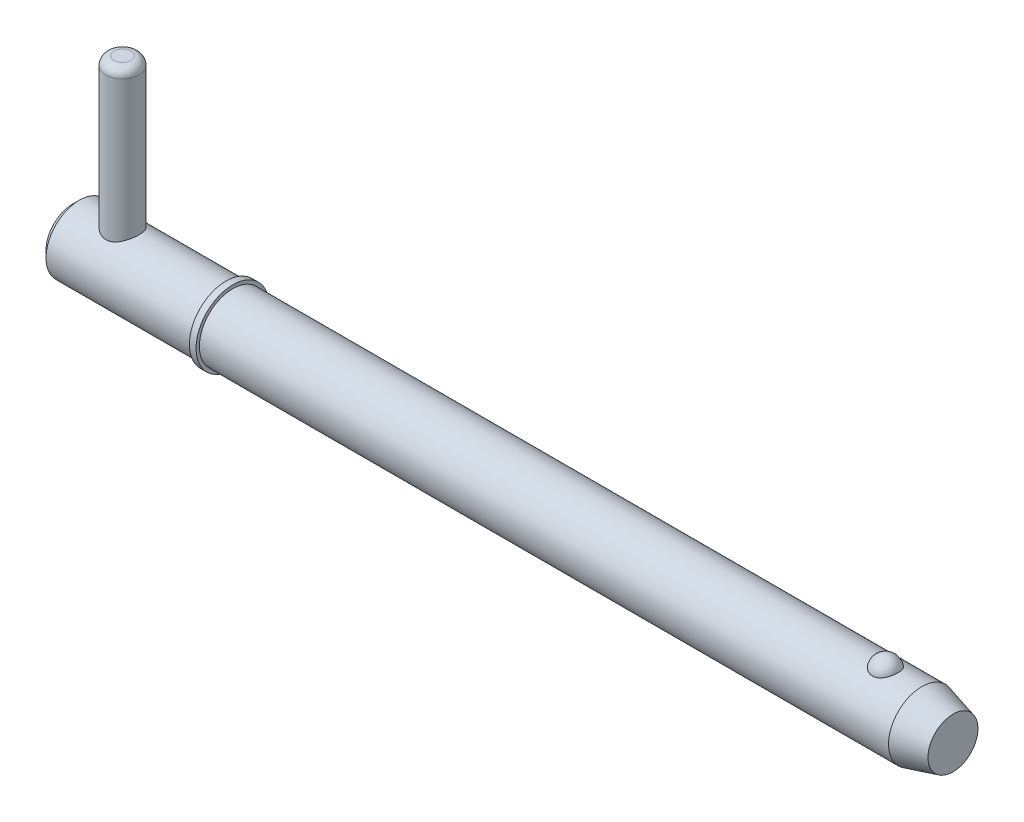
ISO-10303-21;
HEADER;
FILE_DESCRIPTION(('STEP AP214'),'2;1');
FILE_NAME('part.step','',(''),(''),'','','');
FILE_SCHEMA(('AUTOMOTIVE_DESIGN { 1 0 10303 214 1 1 1 1 }'));
ENDSEC;
DATA;
#1=APPLICATION_CONTEXT('core data for automotive mechanical design processes');
#2=APPLICATION_PROTOCOL_DEFINITION('international standard','automotive_design',2000,#1);
#3=PRODUCT_CONTEXT('',#1,'mechanical');
#4=PRODUCT('Part','Part','',(#3));
#5=PRODUCT_RELATED_PRODUCT_CATEGORY('part','',(#4));
#6=PRODUCT_DEFINITION_FORMATION('','',#4);
#7=PRODUCT_DEFINITION_CONTEXT('part definition',#1,'design');
#8=PRODUCT_DEFINITION('design','',#6,#7);
#9=PRODUCT_DEFINITION_SHAPE('','',#8);
#10=(LENGTH_UNIT() NAMED_UNIT(*) SI_UNIT(.MILLI.,.METRE.));
#11=(NAMED_UNIT(*) PLANE_ANGLE_UNIT() SI_UNIT($,.RADIAN.));
#12=(NAMED_UNIT(*) SI_UNIT($,.STERADIAN.) SOLID_ANGLE_UNIT());
#13=UNCERTAINTY_MEASURE_WITH_UNIT(LENGTH_MEASURE(1.E-05),#10,'distance_accuracy_value','');
#14=(GEOMETRIC_REPRESENTATION_CONTEXT(3) GLOBAL_UNCERTAINTY_ASSIGNED_CONTEXT((#13)) GLOBAL_UNIT_ASSIGNED_CONTEXT((#10,
#11,#12)) REPRESENTATION_CONTEXT('',''));
#15=CARTESIAN_POINT('',(0.,0.,0.));
#16=DIRECTION('',(0.,0.,1.));
#17=DIRECTION('',(1.,0.,0.));
#18=AXIS2_PLACEMENT_3D('',#15,#16,#17);
#19=CARTESIAN_POINT('',(5.94,21.43,0.));
#20=DIRECTION('',(0.,-1.,0.));
#21=DIRECTION('',(0.,0.,-1.));
#22=AXIS2_PLACEMENT_3D('',#19,#20,#21);
#23=CYLINDRICAL_SURFACE('',#22,1.98);
#24=CARTESIAN_POINT('',(5.94,-2.98,0.));
#25=DIRECTION('',(0.,1.,0.));
#26=DIRECTION('',(0.,0.,1.));
#27=AXIS2_PLACEMENT_3D('',#24,#25,#26);
#28=CIRCLE('',#27,1.98);
#29=CARTESIAN_POINT('',(5.94,-2.98,1.98));
#30=VERTEX_POINT('',#29);
#31=EDGE_CURVE('P0_E25',#30,#30,#28,.T.);
#32=ORIENTED_EDGE('',*,*,#31,.T.);
#33=EDGE_LOOP('',(#32));
#34=FACE_BOUND('',#33,.T.);
#35=CARTESIAN_POINT('',(5.94,20.44,0.));
#36=DIRECTION('',(0.,1.,0.));
#37=DIRECTION('',(0.,0.,1.));
#38=AXIS2_PLACEMENT_3D('',#35,#36,#37);
#39=CIRCLE('',#38,1.98);
#40=CARTESIAN_POINT('',(5.94,20.44,1.98));
#41=VERTEX_POINT('',#40);
#42=EDGE_CURVE('P0_E29',#41,#41,#39,.F.);
#43=ORIENTED_EDGE('',*,*,#42,.T.);
#44=EDGE_LOOP('',(#43));
#45=FACE_BOUND('',#44,.T.);
#46=ADVANCED_FACE('P0_F14',(#34,#45),#23,.T.);
#47=CARTESIAN_POINT('',(5.94,21.43,0.));
#48=DIRECTION('',(0.,1.,0.));
#49=DIRECTION('',(0.,0.,1.));
#50=AXIS2_PLACEMENT_3D('',#47,#48,#49);
#51=PLANE('',#50);
#52=CARTESIAN_POINT('',(5.94,21.43,0.));
#53=DIRECTION('',(0.,1.,0.));
#54=DIRECTION('',(0.,0.,1.));
#55=AXIS2_PLACEMENT_3D('',#52,#53,#54);
#56=CIRCLE('',#55,0.99);
#57=CARTESIAN_POINT('',(5.94,21.43,0.99));
#58=VERTEX_POINT('',#57);
#59=EDGE_CURVE('P0_E10',#58,#58,#56,.T.);
#60=ORIENTED_EDGE('',*,*,#59,.T.);
#61=EDGE_LOOP('',(#60));
#62=FACE_BOUND('',#61,.T.);
#63=ADVANCED_FACE('P0_F46',(#62),#51,.T.);
#64=CARTESIAN_POINT('',(5.94,-3.97,0.));
#65=DIRECTION('',(0.,1.,0.));
#66=DIRECTION('',(0.,0.,1.));
#67=AXIS2_PLACEMENT_3D('',#64,#65,#66);
#68=PLANE('',#67);
#69=CARTESIAN_POINT('',(5.94,-3.97,0.));
#70=DIRECTION('',(0.,1.,0.));
#71=DIRECTION('',(0.,0.,1.));
#72=AXIS2_PLACEMENT_3D('',#69,#70,#71);
#73=CIRCLE('',#72,0.99);
#74=CARTESIAN_POINT('',(5.94,-3.97,0.99));
#75=VERTEX_POINT('',#74);
#76=EDGE_CURVE('P0_E21',#75,#75,#73,.F.);
#77=ORIENTED_EDGE('',*,*,#76,.T.);
#78=EDGE_LOOP('',(#77));
#79=FACE_BOUND('',#78,.T.);
#80=ADVANCED_FACE('P0_F43',(#79),#68,.F.);
#81=CARTESIAN_POINT('',(5.94,-2.98,0.));
#82=DIRECTION('',(0.,1.,0.));
#83=DIRECTION('',(0.,0.,1.));
#84=AXIS2_PLACEMENT_3D('',#81,#82,#83);
#85=DEGENERATE_TOROIDAL_SURFACE('',#84,0.99,0.99,.T.);
#86=ORIENTED_EDGE('',*,*,#76,.F.);
#87=EDGE_LOOP('',(#86));
#88=FACE_BOUND('',#87,.T.);
#89=ORIENTED_EDGE('',*,*,#31,.F.);
#90=EDGE_LOOP('',(#89));
#91=FACE_BOUND('',#90,.T.);
#92=ADVANCED_FACE('P0_F38',(#88,#91),#85,.T.);
#93=CARTESIAN_POINT('',(5.94,20.44,0.));
#94=DIRECTION('',(0.,1.,0.));
#95=DIRECTION('',(0.,0.,1.));
#96=AXIS2_PLACEMENT_3D('',#93,#94,#95);
#97=DEGENERATE_TOROIDAL_SURFACE('',#96,0.99,0.99,.T.);
#98=ORIENTED_EDGE('',*,*,#42,.F.);
#99=EDGE_LOOP('',(#98));
#100=FACE_BOUND('',#99,.T.);
#101=ORIENTED_EDGE('',*,*,#59,.F.);
#102=EDGE_LOOP('',(#101));
#103=FACE_BOUND('',#102,.T.);
#104=ADVANCED_FACE('P0_F16',(#100,#103),#97,.T.);
#105=CLOSED_SHELL('',(#46,#63,#80,#92,#104));
#106=MANIFOLD_SOLID_BREP('P0_B1',#105);
#107=CARTESIAN_POINT('',(0.,0.,0.));
#108=DIRECTION('',(1.,0.,0.));
#109=DIRECTION('',(0.,0.,-1.));
#110=AXIS2_PLACEMENT_3D('',#107,#108,#109);
#111=CYLINDRICAL_SURFACE('',#110,3.97);
#112=CARTESIAN_POINT('',(101.075939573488,0.,0.));
#113=DIRECTION('',(1.,0.,0.));
#114=DIRECTION('',(0.,0.,-1.));
#115=AXIS2_PLACEMENT_3D('',#112,#113,#114);
#116=CIRCLE('',#115,3.97);
#117=CARTESIAN_POINT('',(101.075939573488,0.,-3.97));
#118=VERTEX_POINT('',#117);
#119=EDGE_CURVE('P1_E81',#118,#118,#116,.T.);
#120=ORIENTED_EDGE('',*,*,#119,.F.);
#121=EDGE_LOOP('',(#120));
#122=FACE_BOUND('',#121,.T.);
#123=CARTESIAN_POINT('',(19.05,0.,0.));
#124=DIRECTION('',(1.,0.,0.));
#125=DIRECTION('',(0.,0.,-1.));
#126=AXIS2_PLACEMENT_3D('',#123,#124,#125);
#127=CIRCLE('',#126,3.97);
#128=CARTESIAN_POINT('',(19.05,0.,-3.97));
#129=VERTEX_POINT('',#128);
#130=EDGE_CURVE('P1_E85',#129,#129,#127,.T.);
#131=ORIENTED_EDGE('',*,*,#130,.T.);
#132=EDGE_LOOP('',(#131));
#133=FACE_BOUND('',#132,.T.);
#134=CARTESIAN_POINT('',(96.7451922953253,3.65715365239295,1.5447094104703));
#135=CARTESIAN_POINT('',(96.6652448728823,3.65716001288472,1.54470290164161));
#136=CARTESIAN_POINT('',(96.5851650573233,3.65987074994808,1.53832549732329));
#137=CARTESIAN_POINT('',(96.4272374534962,3.6704221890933,1.51297018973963));
#138=CARTESIAN_POINT('',(96.3493961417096,3.67827646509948,1.49395894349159));
#139=CARTESIAN_POINT('',(96.1984614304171,3.69818848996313,1.44395950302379));
#140=CARTESIAN_POINT('',(96.1253560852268,3.71023513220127,1.41300293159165));
#141=CARTESIAN_POINT('',(95.9855630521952,3.7372183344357,1.34000212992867));
#142=CARTESIAN_POINT('',(95.9188725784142,3.75215363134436,1.29796274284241));
#143=CARTESIAN_POINT('',(95.7914886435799,3.78384968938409,1.20248834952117));
#144=CARTESIAN_POINT('',(95.7310299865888,3.80065129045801,1.14875388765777));
#145=CARTESIAN_POINT('',(95.6196942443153,3.83398532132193,1.03205417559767));
#146=CARTESIAN_POINT('',(95.5688200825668,3.85051766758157,0.969086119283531));
#147=CARTESIAN_POINT('',(95.4756321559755,3.88238608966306,0.832526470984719));
#148=CARTESIAN_POINT('',(95.4337961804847,3.89763698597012,0.75858832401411));
#149=CARTESIAN_POINT('',(95.3625108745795,3.92451063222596,0.604352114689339));
#150=CARTESIAN_POINT('',(95.3330623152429,3.93613315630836,0.524053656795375));
#151=CARTESIAN_POINT('',(95.2868927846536,3.95467606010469,0.35840348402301));
#152=CARTESIAN_POINT('',(95.2703127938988,3.96154426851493,0.273006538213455));
#153=CARTESIAN_POINT('',(95.250756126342,3.96967008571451,0.100408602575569));
#154=CARTESIAN_POINT('',(95.2477789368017,3.97092790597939,0.0132076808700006));
#155=CARTESIAN_POINT('',(95.2554587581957,3.96771794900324,-0.159844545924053));
#156=CARTESIAN_POINT('',(95.2660164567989,3.96329187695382,-0.245701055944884));
#157=CARTESIAN_POINT('',(95.3003800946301,3.94923163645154,-0.414277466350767));
#158=CARTESIAN_POINT('',(95.3241862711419,3.93959737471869,-0.49699731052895));
#159=CARTESIAN_POINT('',(95.3846114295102,3.91607752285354,-0.657113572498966));
#160=CARTESIAN_POINT('',(95.4212495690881,3.90218558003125,-0.734501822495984));
#161=CARTESIAN_POINT('',(95.5065935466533,3.87158287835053,-0.881704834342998));
#162=CARTESIAN_POINT('',(95.5553004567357,3.85487186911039,-0.951518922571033));
#163=CARTESIAN_POINT('',(95.6641161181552,3.82028735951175,-1.08208159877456));
#164=CARTESIAN_POINT('',(95.7242955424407,3.80240713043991,-1.14276958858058));
#165=CARTESIAN_POINT('',(95.854493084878,3.76758161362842,-1.25282437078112));
#166=CARTESIAN_POINT('',(95.9245105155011,3.75063626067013,-1.30219195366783));
#167=CARTESIAN_POINT('',(96.07118160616,3.71998948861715,-1.38729709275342));
#168=CARTESIAN_POINT('',(96.1476813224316,3.70623183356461,-1.42327904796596));
#169=CARTESIAN_POINT('',(96.3062981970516,3.68323188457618,-1.48178996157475));
#170=CARTESIAN_POINT('',(96.3884132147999,3.67398788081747,-1.50432401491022));
#171=CARTESIAN_POINT('',(96.5514810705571,3.66152163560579,-1.53440939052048));
#172=CARTESIAN_POINT('',(96.6322840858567,3.65801951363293,-1.54265826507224));
#173=CARTESIAN_POINT('',(96.7942085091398,3.65657341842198,-1.54608423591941));
#174=CARTESIAN_POINT('',(96.8753298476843,3.65862829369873,-1.5412640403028));
#175=CARTESIAN_POINT('',(97.0328122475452,3.66788969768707,-1.51908474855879));
#176=CARTESIAN_POINT('',(97.1092422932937,3.67492621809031,-1.50213925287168));
#177=CARTESIAN_POINT('',(97.2580412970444,3.69318404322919,-1.45666982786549));
#178=CARTESIAN_POINT('',(97.3304099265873,3.7044056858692,-1.42814496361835));
#179=CARTESIAN_POINT('',(97.4708029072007,3.73012749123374,-1.35956319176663));
#180=CARTESIAN_POINT('',(97.5387000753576,3.74469307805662,-1.31927107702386));
#181=CARTESIAN_POINT('',(97.6668649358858,3.77545272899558,-1.22847440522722));
#182=CARTESIAN_POINT('',(97.7271308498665,3.79164717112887,-1.17796747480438));
#183=CARTESIAN_POINT('',(97.8416346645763,3.82490325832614,-1.06519260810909));
#184=CARTESIAN_POINT('',(97.8954137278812,3.84196735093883,-1.00245914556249));
#185=CARTESIAN_POINT('',(97.9920988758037,3.87439863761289,-0.868715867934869));
#186=CARTESIAN_POINT('',(98.0350030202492,3.88976552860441,-0.797704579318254));
#187=CARTESIAN_POINT('',(98.110266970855,3.91771381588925,-0.64689620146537));
#188=CARTESIAN_POINT('',(98.1422532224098,3.93019255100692,-0.566893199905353));
#189=CARTESIAN_POINT('',(98.1931101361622,3.95043886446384,-0.402255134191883));
#190=CARTESIAN_POINT('',(98.2119807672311,3.95820643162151,-0.317620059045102));
#191=CARTESIAN_POINT('',(98.2362162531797,3.96823733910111,-0.146156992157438));
#192=CARTESIAN_POINT('',(98.2415874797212,3.970503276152,-0.0593300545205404));
#193=CARTESIAN_POINT('',(98.2387309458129,3.96930811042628,0.114057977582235));
#194=CARTESIAN_POINT('',(98.2305035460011,3.9658471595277,0.20061907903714));
#195=CARTESIAN_POINT('',(98.2007063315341,3.95358562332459,0.37050665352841));
#196=CARTESIAN_POINT('',(98.1792129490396,3.94481563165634,0.453848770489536));
#197=CARTESIAN_POINT('',(98.1233839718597,3.92284586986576,0.615497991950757));
#198=CARTESIAN_POINT('',(98.0890474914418,3.90964579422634,0.693804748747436));
#199=CARTESIAN_POINT('',(98.0079702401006,3.88006987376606,0.8437030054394));
#200=CARTESIAN_POINT('',(97.9611536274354,3.86367478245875,0.915249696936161));
#201=CARTESIAN_POINT('',(97.8561897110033,3.82949741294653,1.04910810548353));
#202=CARTESIAN_POINT('',(97.7980428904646,3.81171519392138,1.11142021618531));
#203=CARTESIAN_POINT('',(97.6717433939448,3.7767336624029,1.22503948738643));
#204=CARTESIAN_POINT('',(97.6035970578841,3.75953398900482,1.27635357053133));
#205=CARTESIAN_POINT('',(97.4589009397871,3.72770506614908,1.36653336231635));
#206=CARTESIAN_POINT('',(97.382348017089,3.7130767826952,1.4053943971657));
#207=CARTESIAN_POINT('',(97.2257594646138,3.68864287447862,1.46830480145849));
#208=CARTESIAN_POINT('',(97.1459307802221,3.67869017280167,1.49281289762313));
#209=CARTESIAN_POINT('',(96.9829877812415,3.66414535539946,1.52817474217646));
#210=CARTESIAN_POINT('',(96.8998840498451,3.65953723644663,1.53906926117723));
#211=CARTESIAN_POINT('',(96.7927760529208,3.6573894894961,1.54414878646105));
#212=CARTESIAN_POINT('',(96.7689900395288,3.65715175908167,1.54471134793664));
#213=CARTESIAN_POINT('',(96.7451922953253,3.65715365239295,1.5447094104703));
#214=B_SPLINE_CURVE_WITH_KNOTS('',3,(#134,#135,#136,#137,#138,#139,#140,#141,#142,#143,#144,
#145,#146,#147,#148,#149,#150,#151,#152,#153,#154,#155,#156,#157,#158,#159,#160,#161,#162,#163,
#164,#165,#166,#167,#168,#169,#170,#171,#172,#173,#174,#175,#176,#177,#178,#179,#180,#181,#182,
#183,#184,#185,#186,#187,#188,#189,#190,#191,#192,#193,#194,#195,#196,#197,#198,#199,#200,#201,
#202,#203,#204,#205,#206,#207,#208,#209,#210,#211,#212,#213),.UNSPECIFIED.,.T.,.F.,(4,2,2,2,2,2,
2,2,2,2,2,2,2,2,2,2,2,2,2,2,2,2,2,2,2,2,2,2,2,2,2,2,2,2,2,2,2,2,2,4),(0.,0.239777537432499,
0.48019041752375,0.719971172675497,0.959647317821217,1.20639040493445,1.45320863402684,
1.71093679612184,1.96868099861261,2.22921052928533,2.48973023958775,2.74834928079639,
3.00697295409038,3.26598440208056,3.52501886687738,3.78570385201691,4.04637062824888,
4.30201257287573,4.55755760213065,4.80022994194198,5.04285200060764,5.2775700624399,
5.51230707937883,5.75210128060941,5.99195126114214,6.24392810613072,6.49594987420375,
6.75588818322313,7.01582710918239,7.27564332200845,7.53545264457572,7.79377886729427,
8.05212290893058,8.31207418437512,8.57201437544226,8.83179046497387,9.09166393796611,
9.34270057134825,9.59298357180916,9.66435753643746),.UNSPECIFIED.);
#215=CARTESIAN_POINT('',(96.7451922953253,3.65715365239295,1.5447094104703));
#216=VERTEX_POINT('',#215);
#217=EDGE_CURVE('P1_E35',#216,#216,#214,.T.);
#218=ORIENTED_EDGE('',*,*,#217,.T.);
#219=EDGE_LOOP('',(#218));
#220=FACE_BOUND('',#219,.T.);
#221=ADVANCED_FACE('P1_F13',(#122,#133,#220),#111,.T.);
#222=CARTESIAN_POINT('',(0.,0.,0.));
#223=DIRECTION('',(-1.,0.,0.));
#224=DIRECTION('',(0.,0.,1.));
#225=AXIS2_PLACEMENT_3D('',#222,#223,#224);
#226=PLANE('',#225);
#227=CARTESIAN_POINT('',(0.,0.,0.));
#228=DIRECTION('',(1.,0.,0.));
#229=DIRECTION('',(0.,0.,-1.));
#230=AXIS2_PLACEMENT_3D('',#227,#228,#229);
#231=CIRCLE('',#230,3.176);
#232=CARTESIAN_POINT('',(0.,0.,-3.176));
#233=VERTEX_POINT('',#232);
#234=EDGE_CURVE('P1_E9',#233,#233,#231,.T.);
#235=ORIENTED_EDGE('',*,*,#234,.F.);
#236=EDGE_LOOP('',(#235));
#237=FACE_BOUND('',#236,.T.);
#238=ADVANCED_FACE('P1_F15',(#237),#226,.T.);
#239=CARTESIAN_POINT('',(0.793999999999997,0.,0.));
#240=DIRECTION('',(1.,0.,0.));
#241=DIRECTION('',(0.,0.,-1.));
#242=AXIS2_PLACEMENT_3D('',#239,#240,#241);
#243=CONICAL_SURFACE('',#242,3.97,0.78539816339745);
#244=ORIENTED_EDGE('',*,*,#234,.T.);
#245=EDGE_LOOP('',(#244));
#246=FACE_BOUND('',#245,.T.);
#247=CARTESIAN_POINT('',(0.793999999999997,0.,0.));
#248=DIRECTION('',(1.,0.,0.));
#249=DIRECTION('',(0.,0.,-1.));
#250=AXIS2_PLACEMENT_3D('',#247,#248,#249);
#251=CIRCLE('',#250,3.97);
#252=CARTESIAN_POINT('',(0.793999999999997,0.,-3.97));
#253=VERTEX_POINT('',#252);
#254=EDGE_CURVE('P1_E26',#253,#253,#251,.T.);
#255=ORIENTED_EDGE('',*,*,#254,.F.);
#256=EDGE_LOOP('',(#255));
#257=FACE_BOUND('',#256,.T.);
#258=ADVANCED_FACE('P1_F77',(#246,#257),#243,.T.);
#259=CARTESIAN_POINT('',(0.,0.,0.));
#260=DIRECTION('',(1.,0.,0.));
#261=DIRECTION('',(0.,0.,-1.));
#262=AXIS2_PLACEMENT_3D('',#259,#260,#261);
#263=CYLINDRICAL_SURFACE('',#262,3.97);
#264=CARTESIAN_POINT('',(5.94,-3.44100276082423,1.98));
#265=CARTESIAN_POINT('',(5.8367885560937,-3.44101282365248,1.97999171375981));
#266=CARTESIAN_POINT('',(5.73344176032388,-3.44571749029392,1.97187534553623));
#267=CARTESIAN_POINT('',(5.52991905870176,-3.46385873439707,1.93981946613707));
#268=CARTESIAN_POINT('',(5.42975031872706,-3.47731375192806,1.91584653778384));
#269=CARTESIAN_POINT('',(5.23590869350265,-3.51100678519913,1.85336773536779));
#270=CARTESIAN_POINT('',(5.14220446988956,-3.53120882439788,1.81493880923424));
#271=CARTESIAN_POINT('',(4.9625969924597,-3.57606420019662,1.72487335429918));
#272=CARTESIAN_POINT('',(4.87669412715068,-3.6007177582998,1.67323616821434));
#273=CARTESIAN_POINT('',(4.70734412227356,-3.65417020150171,1.55325205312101));
#274=CARTESIAN_POINT('',(4.62467662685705,-3.68314323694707,1.4838818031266));
#275=CARTESIAN_POINT('',(4.47154355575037,-3.74056406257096,1.33252902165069));
#276=CARTESIAN_POINT('',(4.40108404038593,-3.76901158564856,1.25054026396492));
#277=CARTESIAN_POINT('',(4.26974803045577,-3.82445556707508,1.06956584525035));
#278=CARTESIAN_POINT('',(4.20982960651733,-3.8512271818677,0.969809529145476));
#279=CARTESIAN_POINT('',(4.10798077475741,-3.89804342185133,0.760047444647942));
#280=CARTESIAN_POINT('',(4.06603907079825,-3.91809226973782,0.650048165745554));
#281=CARTESIAN_POINT('',(4.00441878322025,-3.94794912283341,0.431181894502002));
#282=CARTESIAN_POINT('',(3.98337329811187,-3.95838209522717,0.322786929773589));
#283=CARTESIAN_POINT('',(3.9596425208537,-3.97016407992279,0.103541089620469));
#284=CARTESIAN_POINT('',(3.95694618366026,-3.97151855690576,-0.00730826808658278));
#285=CARTESIAN_POINT('',(3.9694599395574,-3.96528826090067,-0.218044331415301));
#286=CARTESIAN_POINT('',(3.98314071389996,-3.95846689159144,-0.318049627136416));
#287=CARTESIAN_POINT('',(4.02528522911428,-3.93780347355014,-0.514124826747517));
#288=CARTESIAN_POINT('',(4.05375007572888,-3.92396089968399,-0.61019443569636));
#289=CARTESIAN_POINT('',(4.12484256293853,-3.89028355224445,-0.797351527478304));
#290=CARTESIAN_POINT('',(4.16766142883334,-3.87036821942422,-0.888351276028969));
#291=CARTESIAN_POINT('',(4.26598377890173,-3.82634285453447,-1.06209448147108));
#292=CARTESIAN_POINT('',(4.32149181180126,-3.8022313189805,-1.14483496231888));
#293=CARTESIAN_POINT('',(4.44962332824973,-3.74940011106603,-1.30802500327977));
#294=CARTESIAN_POINT('',(4.52336636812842,-3.72046031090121,-1.38752498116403));
#295=CARTESIAN_POINT('',(4.68287656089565,-3.66269463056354,-1.53354043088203));
#296=CARTESIAN_POINT('',(4.7686527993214,-3.63386885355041,-1.60004599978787));
#297=CARTESIAN_POINT('',(4.9564069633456,-3.57763161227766,-1.72228426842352));
#298=CARTESIAN_POINT('',(5.05906485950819,-3.5504233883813,-1.77707534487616));
#299=CARTESIAN_POINT('',(5.27381412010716,-3.50334038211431,-1.86819784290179));
#300=CARTESIAN_POINT('',(5.38589553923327,-3.48345798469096,-1.90454844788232));
#301=CARTESIAN_POINT('',(5.6069795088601,-3.45548331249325,-1.95481643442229));
#302=CARTESIAN_POINT('',(5.71552407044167,-3.44658268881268,-1.97028113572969));
#303=CARTESIAN_POINT('',(5.93399639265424,-3.43928114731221,-1.98300600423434));
#304=CARTESIAN_POINT('',(6.04392313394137,-3.44087289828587,-1.98027888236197));
#305=CARTESIAN_POINT('',(6.24931618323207,-3.45351901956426,-1.95811780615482));
#306=CARTESIAN_POINT('',(6.34505668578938,-3.46352725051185,-1.94052989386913));
#307=CARTESIAN_POINT('',(6.53204702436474,-3.49033612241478,-1.89188242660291));
#308=CARTESIAN_POINT('',(6.62329540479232,-3.50713894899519,-1.86081853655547));
#309=CARTESIAN_POINT('',(6.80352105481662,-3.54655680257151,-1.78458666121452));
#310=CARTESIAN_POINT('',(6.89219712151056,-3.56940508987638,-1.73883178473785));
#311=CARTESIAN_POINT('',(7.06112449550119,-3.61813012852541,-1.63502913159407));
#312=CARTESIAN_POINT('',(7.14137144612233,-3.6440084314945,-1.57697504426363));
#313=CARTESIAN_POINT('',(7.30168083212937,-3.69977514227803,-1.44171920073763));
#314=CARTESIAN_POINT('',(7.38046039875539,-3.7297597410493,-1.36302972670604));
#315=CARTESIAN_POINT('',(7.52409649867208,-3.78754991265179,-1.19307190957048));
#316=CARTESIAN_POINT('',(7.58894840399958,-3.81535475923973,-1.10179940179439));
#317=CARTESIAN_POINT('',(7.70430122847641,-3.86658972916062,-0.906019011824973));
#318=CARTESIAN_POINT('',(7.75438714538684,-3.88988795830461,-0.801229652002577));
#319=CARTESIAN_POINT('',(7.83572184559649,-3.92848199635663,-0.583216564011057));
#320=CARTESIAN_POINT('',(7.86698708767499,-3.94378479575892,-0.470000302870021));
#321=CARTESIAN_POINT('',(7.90711051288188,-3.96355307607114,-0.249525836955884));
#322=CARTESIAN_POINT('',(7.91775648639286,-3.96888171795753,-0.142669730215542));
#323=CARTESIAN_POINT('',(7.92160247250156,-3.97079858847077,0.0714191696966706));
#324=CARTESIAN_POINT('',(7.91480852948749,-3.96738984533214,0.178651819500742));
#325=CARTESIAN_POINT('',(7.88515479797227,-3.9527181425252,0.383072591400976));
#326=CARTESIAN_POINT('',(7.8633739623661,-3.94198303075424,0.480459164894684));
#327=CARTESIAN_POINT('',(7.80581513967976,-3.91422178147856,0.670038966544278));
#328=CARTESIAN_POINT('',(7.77003513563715,-3.89719473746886,0.762231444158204));
#329=CARTESIAN_POINT('',(7.68389191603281,-3.85747818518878,0.943248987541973));
#330=CARTESIAN_POINT('',(7.63296879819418,-3.83457704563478,1.03175978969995));
#331=CARTESIAN_POINT('',(7.51869140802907,-3.7855122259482,1.19934744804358));
#332=CARTESIAN_POINT('',(7.45533142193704,-3.75934704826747,1.2784199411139));
#333=CARTESIAN_POINT('',(7.31068939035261,-3.70329841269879,1.433144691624));
#334=CARTESIAN_POINT('',(7.22825362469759,-3.67330340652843,1.50768183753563));
#335=CARTESIAN_POINT('',(7.05162367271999,-3.61514025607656,1.64226879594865));
#336=CARTESIAN_POINT('',(6.95741928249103,-3.58697372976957,1.70230590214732));
#337=CARTESIAN_POINT('',(6.75590859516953,-3.53504049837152,1.80775364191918));
#338=CARTESIAN_POINT('',(6.64828786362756,-3.51143624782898,1.85265616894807));
#339=CARTESIAN_POINT('',(6.48137774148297,-3.48289659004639,1.90544537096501));
#340=CARTESIAN_POINT('',(6.42488151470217,-3.4745323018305,1.9206071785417));
#341=CARTESIAN_POINT('',(6.31046920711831,-3.4604244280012,1.94591259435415));
#342=CARTESIAN_POINT('',(6.25255415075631,-3.45467900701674,1.95605971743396));
#343=CARTESIAN_POINT('',(6.1521444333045,-3.44728060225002,1.96905939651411));
#344=CARTESIAN_POINT('',(6.10985721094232,-3.44493297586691,1.97315742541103));
#345=CARTESIAN_POINT('',(6.02505433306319,-3.44179192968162,1.97862952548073));
#346=CARTESIAN_POINT('',(5.98253866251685,-3.44099861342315,1.98000341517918));
#347=CARTESIAN_POINT('',(5.94,-3.44100276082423,1.98));
#348=B_SPLINE_CURVE_WITH_KNOTS('',3,(#264,#265,#266,#267,#268,#269,#270,#271,#272,#273,#274,
#275,#276,#277,#278,#279,#280,#281,#282,#283,#284,#285,#286,#287,#288,#289,#290,#291,#292,#293,
#294,#295,#296,#297,#298,#299,#300,#301,#302,#303,#304,#305,#306,#307,#308,#309,#310,#311,#312,
#313,#314,#315,#316,#317,#318,#319,#320,#321,#322,#323,#324,#325,#326,#327,#328,#329,#330,#331,
#332,#333,#334,#335,#336,#337,#338,#339,#340,#341,#342,#343,#344,#345,#346,#347),.UNSPECIFIED.,
.T.,.F.,(4,2,2,2,2,2,2,2,2,2,2,2,2,2,2,2,2,2,2,2,2,2,2,2,2,2,2,2,2,2,2,2,2,2,2,2,2,2,2,2,2,4),
(0.,0.309462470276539,0.619579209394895,0.928068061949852,1.23657226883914,1.57038619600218,
1.90436536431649,2.26071614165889,2.61684266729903,2.94773555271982,3.27842924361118,
3.58050679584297,3.88260694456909,4.18890317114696,4.49530936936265,4.83057163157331,
5.1660884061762,5.52272472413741,5.87898927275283,6.20706708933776,6.53491569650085,
6.82716910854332,7.11951660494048,7.42541184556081,7.73146442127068,8.07586334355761,
8.42037652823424,8.77380887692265,9.12693169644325,9.44775848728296,9.76847409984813,
10.0682302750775,10.3680296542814,10.6806938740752,10.9935020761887,11.3373031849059,
11.6814044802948,12.0361164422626,12.2131519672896,12.3900632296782,12.5175998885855,
12.6451450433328),.UNSPECIFIED.);
#349=CARTESIAN_POINT('',(5.94,-3.44100276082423,1.98));
#350=VERTEX_POINT('',#349);
#351=EDGE_CURVE('P1_E17',#350,#350,#348,.T.);
#352=ORIENTED_EDGE('',*,*,#351,.F.);
#353=EDGE_LOOP('',(#352));
#354=FACE_BOUND('',#353,.T.);
#355=CARTESIAN_POINT('',(5.94,3.44100276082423,1.98));
#356=CARTESIAN_POINT('',(6.0432114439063,3.44101282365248,1.97999171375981));
#357=CARTESIAN_POINT('',(6.14655823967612,3.44571749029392,1.97187534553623));
#358=CARTESIAN_POINT('',(6.35008094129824,3.46385873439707,1.93981946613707));
#359=CARTESIAN_POINT('',(6.45024968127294,3.47731375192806,1.91584653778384));
#360=CARTESIAN_POINT('',(6.64409130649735,3.51100678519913,1.85336773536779));
#361=CARTESIAN_POINT('',(6.73779553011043,3.53120882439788,1.81493880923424));
#362=CARTESIAN_POINT('',(6.91740300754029,3.57606420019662,1.72487335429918));
#363=CARTESIAN_POINT('',(7.00330587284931,3.6007177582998,1.67323616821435));
#364=CARTESIAN_POINT('',(7.17265587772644,3.65417020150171,1.55325205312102));
#365=CARTESIAN_POINT('',(7.25532337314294,3.68314323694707,1.4838818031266));
#366=CARTESIAN_POINT('',(7.40845644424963,3.74056406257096,1.3325290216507));
#367=CARTESIAN_POINT('',(7.47891595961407,3.76901158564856,1.25054026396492));
#368=CARTESIAN_POINT('',(7.61025196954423,3.82445556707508,1.06956584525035));
#369=CARTESIAN_POINT('',(7.67017039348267,3.8512271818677,0.969809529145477));
#370=CARTESIAN_POINT('',(7.77201922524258,3.89804342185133,0.760047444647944));
#371=CARTESIAN_POINT('',(7.81396092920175,3.91809226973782,0.650048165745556));
#372=CARTESIAN_POINT('',(7.87558121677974,3.94794912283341,0.431181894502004));
#373=CARTESIAN_POINT('',(7.89662670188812,3.95838209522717,0.322786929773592));
#374=CARTESIAN_POINT('',(7.9203574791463,3.97016407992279,0.103541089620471));
#375=CARTESIAN_POINT('',(7.92305381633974,3.97151855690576,-0.00730826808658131));
#376=CARTESIAN_POINT('',(7.9105400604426,3.96528826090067,-0.2180443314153));
#377=CARTESIAN_POINT('',(7.89685928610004,3.95846689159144,-0.318049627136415));
#378=CARTESIAN_POINT('',(7.85471477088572,3.93780347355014,-0.514124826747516));
#379=CARTESIAN_POINT('',(7.82624992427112,3.92396089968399,-0.61019443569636));
#380=CARTESIAN_POINT('',(7.75515743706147,3.89028355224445,-0.797351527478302));
#381=CARTESIAN_POINT('',(7.71233857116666,3.87036821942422,-0.888351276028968));
#382=CARTESIAN_POINT('',(7.61401622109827,3.82634285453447,-1.06209448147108));
#383=CARTESIAN_POINT('',(7.55850818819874,3.8022313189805,-1.14483496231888));
#384=CARTESIAN_POINT('',(7.43037667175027,3.74940011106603,-1.30802500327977));
#385=CARTESIAN_POINT('',(7.35663363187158,3.72046031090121,-1.38752498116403));
#386=CARTESIAN_POINT('',(7.19712343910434,3.66269463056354,-1.53354043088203));
#387=CARTESIAN_POINT('',(7.1113472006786,3.63386885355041,-1.60004599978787));
#388=CARTESIAN_POINT('',(6.9235930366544,3.57763161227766,-1.72228426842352));
#389=CARTESIAN_POINT('',(6.82093514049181,3.5504233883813,-1.77707534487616));
#390=CARTESIAN_POINT('',(6.60618587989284,3.50334038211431,-1.86819784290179));
#391=CARTESIAN_POINT('',(6.49410446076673,3.48345798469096,-1.90454844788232));
#392=CARTESIAN_POINT('',(6.2730204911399,3.45548331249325,-1.95481643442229));
#393=CARTESIAN_POINT('',(6.16447592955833,3.44658268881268,-1.97028113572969));
#394=CARTESIAN_POINT('',(5.94600360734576,3.43928114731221,-1.98300600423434));
#395=CARTESIAN_POINT('',(5.83607686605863,3.44087289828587,-1.98027888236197));
#396=CARTESIAN_POINT('',(5.63068381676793,3.45351901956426,-1.95811780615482));
#397=CARTESIAN_POINT('',(5.53494331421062,3.46352725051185,-1.94052989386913));
#398=CARTESIAN_POINT('',(5.34795297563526,3.49033612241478,-1.89188242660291));
#399=CARTESIAN_POINT('',(5.25670459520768,3.50713894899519,-1.86081853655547));
#400=CARTESIAN_POINT('',(5.07647894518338,3.54655680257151,-1.78458666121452));
#401=CARTESIAN_POINT('',(4.98780287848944,3.56940508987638,-1.73883178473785));
#402=CARTESIAN_POINT('',(4.81887550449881,3.61813012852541,-1.63502913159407));
#403=CARTESIAN_POINT('',(4.73862855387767,3.6440084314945,-1.57697504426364));
#404=CARTESIAN_POINT('',(4.57831916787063,3.69977514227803,-1.44171920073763));
#405=CARTESIAN_POINT('',(4.49953960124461,3.7297597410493,-1.36302972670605));
#406=CARTESIAN_POINT('',(4.35590350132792,3.78754991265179,-1.19307190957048));
#407=CARTESIAN_POINT('',(4.29105159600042,3.81535475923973,-1.10179940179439));
#408=CARTESIAN_POINT('',(4.17569877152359,3.86658972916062,-0.906019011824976));
#409=CARTESIAN_POINT('',(4.12561285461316,3.88988795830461,-0.80122965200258));
#410=CARTESIAN_POINT('',(4.04427815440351,3.92848199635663,-0.58321656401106));
#411=CARTESIAN_POINT('',(4.01301291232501,3.94378479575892,-0.470000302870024));
#412=CARTESIAN_POINT('',(3.97288948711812,3.96355307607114,-0.249525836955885));
#413=CARTESIAN_POINT('',(3.96224351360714,3.96888171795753,-0.142669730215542));
#414=CARTESIAN_POINT('',(3.95839752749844,3.97079858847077,0.0714191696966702));
#415=CARTESIAN_POINT('',(3.96519147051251,3.96738984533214,0.178651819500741));
#416=CARTESIAN_POINT('',(3.99484520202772,3.9527181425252,0.383072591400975));
#417=CARTESIAN_POINT('',(4.01662603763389,3.94198303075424,0.480459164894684));
#418=CARTESIAN_POINT('',(4.07418486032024,3.91422178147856,0.670038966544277));
#419=CARTESIAN_POINT('',(4.10996486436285,3.89719473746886,0.762231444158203));
#420=CARTESIAN_POINT('',(4.19610808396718,3.85747818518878,0.943248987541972));
#421=CARTESIAN_POINT('',(4.24703120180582,3.83457704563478,1.03175978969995));
#422=CARTESIAN_POINT('',(4.36130859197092,3.7855122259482,1.19934744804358));
#423=CARTESIAN_POINT('',(4.42466857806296,3.75934704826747,1.2784199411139));
#424=CARTESIAN_POINT('',(4.56931060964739,3.70329841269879,1.433144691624));
#425=CARTESIAN_POINT('',(4.65174637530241,3.67330340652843,1.50768183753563));
#426=CARTESIAN_POINT('',(4.82837632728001,3.61514025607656,1.64226879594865));
#427=CARTESIAN_POINT('',(4.92258071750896,3.58697372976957,1.70230590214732));
#428=CARTESIAN_POINT('',(5.12409140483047,3.53504049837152,1.80775364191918));
#429=CARTESIAN_POINT('',(5.23171213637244,3.51143624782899,1.85265616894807));
#430=CARTESIAN_POINT('',(5.39862225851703,3.48289659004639,1.90544537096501));
#431=CARTESIAN_POINT('',(5.45511848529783,3.4745323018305,1.9206071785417));
#432=CARTESIAN_POINT('',(5.56953079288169,3.4604244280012,1.94591259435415));
#433=CARTESIAN_POINT('',(5.62744584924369,3.45467900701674,1.95605971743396));
#434=CARTESIAN_POINT('',(5.7278555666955,3.44728060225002,1.9690593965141));
#435=CARTESIAN_POINT('',(5.77014278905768,3.44493297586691,1.97315742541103));
#436=CARTESIAN_POINT('',(5.85494566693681,3.44179192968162,1.97862952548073));
#437=CARTESIAN_POINT('',(5.89746133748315,3.44099861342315,1.98000341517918));
#438=CARTESIAN_POINT('',(5.94,3.44100276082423,1.98));
#439=B_SPLINE_CURVE_WITH_KNOTS('',3,(#355,#356,#357,#358,#359,#360,#361,#362,#363,#364,#365,
#366,#367,#368,#369,#370,#371,#372,#373,#374,#375,#376,#377,#378,#379,#380,#381,#382,#383,#384,
#385,#386,#387,#388,#389,#390,#391,#392,#393,#394,#395,#396,#397,#398,#399,#400,#401,#402,#403,
#404,#405,#406,#407,#408,#409,#410,#411,#412,#413,#414,#415,#416,#417,#418,#419,#420,#421,#422,
#423,#424,#425,#426,#427,#428,#429,#430,#431,#432,#433,#434,#435,#436,#437,#438),.UNSPECIFIED.,
.T.,.F.,(4,2,2,2,2,2,2,2,2,2,2,2,2,2,2,2,2,2,2,2,2,2,2,2,2,2,2,2,2,2,2,2,2,2,2,2,2,2,2,2,2,4),
(0.,0.309462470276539,0.619579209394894,0.928068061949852,1.23657226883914,1.57038619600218,
1.90436536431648,2.26071614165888,2.61684266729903,2.94773555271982,3.27842924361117,
3.58050679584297,3.88260694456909,4.18890317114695,4.49530936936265,4.83057163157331,
5.1660884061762,5.5227247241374,5.87898927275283,6.20706708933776,6.53491569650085,
6.82716910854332,7.11951660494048,7.42541184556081,7.73146442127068,8.07586334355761,
8.42037652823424,8.77380887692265,9.12693169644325,9.44775848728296,9.76847409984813,
10.0682302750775,10.3680296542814,10.6806938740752,10.9935020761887,11.3373031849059,
11.6814044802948,12.0361164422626,12.2131519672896,12.3900632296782,12.5175998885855,
12.6451450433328),.UNSPECIFIED.);
#440=CARTESIAN_POINT('',(5.94,3.44100276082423,1.98));
#441=VERTEX_POINT('',#440);
#442=EDGE_CURVE('P1_E43',#441,#441,#439,.T.);
#443=ORIENTED_EDGE('',*,*,#442,.F.);
#444=EDGE_LOOP('',(#443));
#445=FACE_BOUND('',#444,.T.);
#446=ORIENTED_EDGE('',*,*,#254,.T.);
#447=EDGE_LOOP('',(#446));
#448=FACE_BOUND('',#447,.T.);
#449=CARTESIAN_POINT('',(18.256,0.,0.));
#450=DIRECTION('',(1.,0.,0.));
#451=DIRECTION('',(0.,0.,-1.));
#452=AXIS2_PLACEMENT_3D('',#449,#450,#451);
#453=CIRCLE('',#452,3.97);
#454=CARTESIAN_POINT('',(18.256,0.,-3.97));
#455=VERTEX_POINT('',#454);
#456=EDGE_CURVE('P1_E31',#455,#455,#453,.T.);
#457=ORIENTED_EDGE('',*,*,#456,.F.);
#458=EDGE_LOOP('',(#457));
#459=FACE_BOUND('',#458,.T.);
#460=ADVANCED_FACE('P1_F103',(#354,#445,#448,#459),#263,.T.);
#461=CARTESIAN_POINT('',(18.256,3.97,0.));
#462=DIRECTION('',(-1.,0.,0.));
#463=DIRECTION('',(0.,0.,1.));
#464=AXIS2_PLACEMENT_3D('',#461,#462,#463);
#465=PLANE('',#464);
#466=ORIENTED_EDGE('',*,*,#456,.T.);
#467=EDGE_LOOP('',(#466));
#468=FACE_BOUND('',#467,.T.);
#469=CARTESIAN_POINT('',(18.256,0.,0.));
#470=DIRECTION('',(1.,0.,0.));
#471=DIRECTION('',(0.,0.,-1.));
#472=AXIS2_PLACEMENT_3D('',#469,#470,#471);
#473=CIRCLE('',#472,4.367);
#474=CARTESIAN_POINT('',(18.256,0.,-4.367));
#475=VERTEX_POINT('',#474);
#476=EDGE_CURVE('P1_E91',#475,#475,#473,.T.);
#477=ORIENTED_EDGE('',*,*,#476,.F.);
#478=EDGE_LOOP('',(#477));
#479=FACE_BOUND('',#478,.T.);
#480=ADVANCED_FACE('P1_F100',(#468,#479),#465,.T.);
#481=CARTESIAN_POINT('',(0.,0.,0.));
#482=DIRECTION('',(1.,0.,0.));
#483=DIRECTION('',(0.,0.,-1.));
#484=AXIS2_PLACEMENT_3D('',#481,#482,#483);
#485=CYLINDRICAL_SURFACE('',#484,4.367);
#486=ORIENTED_EDGE('',*,*,#476,.T.);
#487=EDGE_LOOP('',(#486));
#488=FACE_BOUND('',#487,.T.);
#489=CARTESIAN_POINT('',(19.05,0.,0.));
#490=DIRECTION('',(1.,0.,0.));
#491=DIRECTION('',(0.,0.,-1.));
#492=AXIS2_PLACEMENT_3D('',#489,#490,#491);
#493=CIRCLE('',#492,4.367);
#494=CARTESIAN_POINT('',(19.05,0.,-4.367));
#495=VERTEX_POINT('',#494);
#496=EDGE_CURVE('P1_E88',#495,#495,#493,.T.);
#497=ORIENTED_EDGE('',*,*,#496,.F.);
#498=EDGE_LOOP('',(#497));
#499=FACE_BOUND('',#498,.T.);
#500=ADVANCED_FACE('P1_F68',(#488,#499),#485,.T.);
#501=CARTESIAN_POINT('',(19.05,4.367,0.));
#502=DIRECTION('',(1.,0.,0.));
#503=DIRECTION('',(0.,0.,-1.));
#504=AXIS2_PLACEMENT_3D('',#501,#502,#503);
#505=PLANE('',#504);
#506=ORIENTED_EDGE('',*,*,#496,.T.);
#507=EDGE_LOOP('',(#506));
#508=FACE_BOUND('',#507,.T.);
#509=ORIENTED_EDGE('',*,*,#130,.F.);
#510=EDGE_LOOP('',(#509));
#511=FACE_BOUND('',#510,.T.);
#512=ADVANCED_FACE('P1_F62',(#508,#511),#505,.T.);
#513=CARTESIAN_POINT('',(104.78,0.,0.));
#514=DIRECTION('',(-1.,0.,0.));
#515=DIRECTION('',(0.,0.,1.));
#516=AXIS2_PLACEMENT_3D('',#513,#514,#515);
#517=CONICAL_SURFACE('',#516,2.97750000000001,0.26179938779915);
#518=ORIENTED_EDGE('',*,*,#119,.T.);
#519=EDGE_LOOP('',(#518));
#520=FACE_BOUND('',#519,.T.);
#521=CARTESIAN_POINT('',(104.78,0.,0.));
#522=DIRECTION('',(1.,0.,0.));
#523=DIRECTION('',(0.,0.,-1.));
#524=AXIS2_PLACEMENT_3D('',#521,#522,#523);
#525=CIRCLE('',#524,2.97750000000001);
#526=CARTESIAN_POINT('',(104.78,0.,-2.97750000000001));
#527=VERTEX_POINT('',#526);
#528=EDGE_CURVE('P1_E42',#527,#527,#525,.T.);
#529=ORIENTED_EDGE('',*,*,#528,.F.);
#530=EDGE_LOOP('',(#529));
#531=FACE_BOUND('',#530,.T.);
#532=ADVANCED_FACE('P1_F59',(#520,#531),#517,.T.);
#533=CARTESIAN_POINT('',(104.78,2.97750000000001,0.));
#534=DIRECTION('',(1.,0.,0.));
#535=DIRECTION('',(0.,0.,-1.));
#536=AXIS2_PLACEMENT_3D('',#533,#534,#535);
#537=PLANE('',#536);
#538=ORIENTED_EDGE('',*,*,#528,.T.);
#539=EDGE_LOOP('',(#538));
#540=FACE_BOUND('',#539,.T.);
#541=ADVANCED_FACE('P1_F55',(#540),#537,.T.);
#542=CARTESIAN_POINT('',(96.7451922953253,3.573,0.));
#543=DIRECTION('',(-1.,0.,0.));
#544=DIRECTION('',(0.,1.,0.));
#545=AXIS2_PLACEMENT_3D('',#542,#543,#544);
#546=SPHERICAL_SURFACE('',#545,1.54700000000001);
#547=ORIENTED_EDGE('',*,*,#217,.F.);
#548=EDGE_LOOP('',(#547));
#549=FACE_BOUND('',#548,.T.);
#550=ADVANCED_FACE('P1_F50',(#549),#546,.T.);
#551=CARTESIAN_POINT('',(5.94,-4.367,0.));
#552=DIRECTION('',(0.,1.,0.));
#553=DIRECTION('',(0.,0.,1.));
#554=AXIS2_PLACEMENT_3D('',#551,#552,#553);
#555=CYLINDRICAL_SURFACE('',#554,1.98);
#556=ORIENTED_EDGE('',*,*,#351,.T.);
#557=EDGE_LOOP('',(#556));
#558=FACE_BOUND('',#557,.T.);
#559=ORIENTED_EDGE('',*,*,#442,.T.);
#560=EDGE_LOOP('',(#559));
#561=FACE_BOUND('',#560,.T.);
#562=ADVANCED_FACE('P1_F54',(#558,#561),#555,.F.);
#563=CLOSED_SHELL('',(#221,#238,#258,#460,#480,#500,#512,#532,#541,#550,#562));
#564=MANIFOLD_SOLID_BREP('P1_B1',#563);
#565=ADVANCED_BREP_SHAPE_REPRESENTATION('',(#18,#106,#564),#14);
#566=SHAPE_DEFINITION_REPRESENTATION(#9,#565);
ENDSEC;
END-ISO-10303-21;
